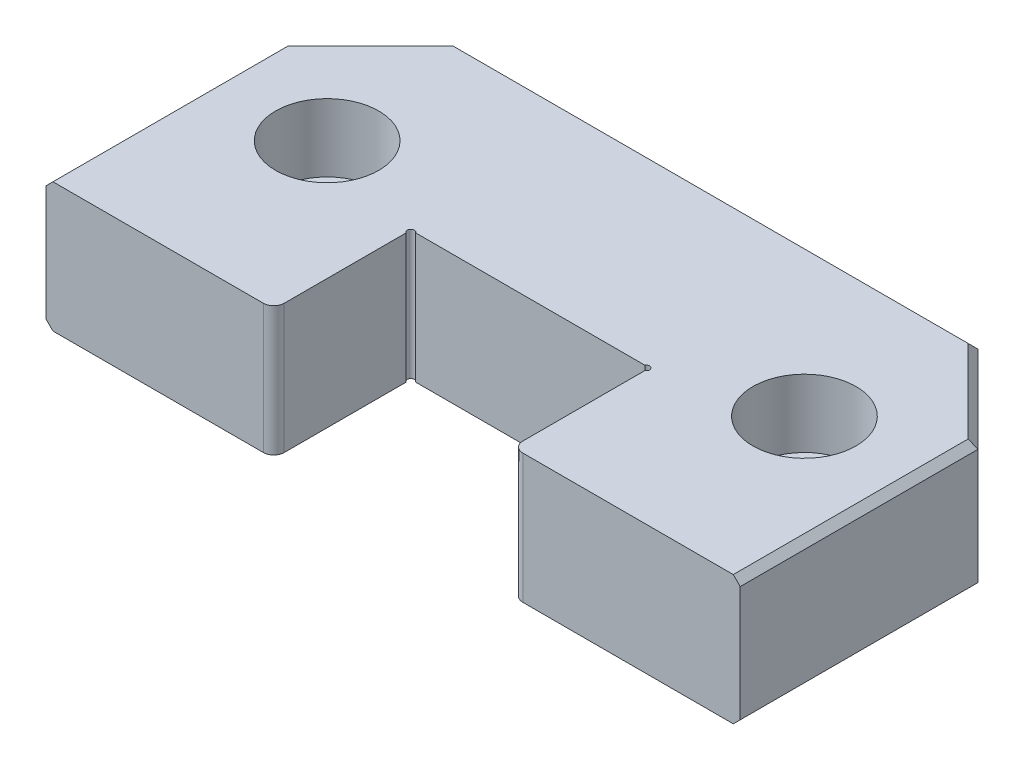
ISO-10303-21;
HEADER;
FILE_DESCRIPTION(('STEP AP214'),'2;1');
FILE_NAME('part.step','',(''),(''),'','','');
FILE_SCHEMA(('AUTOMOTIVE_DESIGN { 1 0 10303 214 1 1 1 1 }'));
ENDSEC;
DATA;
#1=APPLICATION_CONTEXT('core data for automotive mechanical design processes');
#2=APPLICATION_PROTOCOL_DEFINITION('international standard','automotive_design',2000,#1);
#3=PRODUCT_CONTEXT('',#1,'mechanical');
#4=PRODUCT('Part','Part','',(#3));
#5=PRODUCT_RELATED_PRODUCT_CATEGORY('part','',(#4));
#6=PRODUCT_DEFINITION_FORMATION('','',#4);
#7=PRODUCT_DEFINITION_CONTEXT('part definition',#1,'design');
#8=PRODUCT_DEFINITION('design','',#6,#7);
#9=PRODUCT_DEFINITION_SHAPE('','',#8);
#10=(LENGTH_UNIT() NAMED_UNIT(*) SI_UNIT(.MILLI.,.METRE.));
#11=(NAMED_UNIT(*) PLANE_ANGLE_UNIT() SI_UNIT($,.RADIAN.));
#12=(NAMED_UNIT(*) SI_UNIT($,.STERADIAN.) SOLID_ANGLE_UNIT());
#13=UNCERTAINTY_MEASURE_WITH_UNIT(LENGTH_MEASURE(1.E-05),#10,'distance_accuracy_value','');
#14=(GEOMETRIC_REPRESENTATION_CONTEXT(3) GLOBAL_UNCERTAINTY_ASSIGNED_CONTEXT((#13)) GLOBAL_UNIT_ASSIGNED_CONTEXT((#10,
#11,#12)) REPRESENTATION_CONTEXT('',''));
#15=CARTESIAN_POINT('',(0.,0.,0.));
#16=DIRECTION('',(0.,0.,1.));
#17=DIRECTION('',(1.,0.,0.));
#18=AXIS2_PLACEMENT_3D('',#15,#16,#17);
#19=CARTESIAN_POINT('',(-34.925,15.748,-25.273));
#20=DIRECTION('',(0.,-1.,0.));
#21=DIRECTION('',(0.,0.,-1.));
#22=AXIS2_PLACEMENT_3D('',#19,#20,#21);
#23=CYLINDRICAL_SURFACE('',#22,5.1562);
#24=CARTESIAN_POINT('',(-34.925,0.,-25.273));
#25=DIRECTION('',(0.,-1.,0.));
#26=DIRECTION('',(0.,0.,-1.));
#27=AXIS2_PLACEMENT_3D('',#24,#25,#26);
#28=CIRCLE('',#27,5.1562);
#29=CARTESIAN_POINT('',(-34.925,0.,-30.4292));
#30=VERTEX_POINT('',#29);
#31=EDGE_CURVE('E267',#30,#30,#28,.T.);
#32=ORIENTED_EDGE('',*,*,#31,.T.);
#33=EDGE_LOOP('',(#32));
#34=FACE_BOUND('',#33,.T.);
#35=CARTESIAN_POINT('',(-34.925,8.9916,-25.273));
#36=DIRECTION('',(0.,1.,0.));
#37=DIRECTION('',(0.,0.,1.));
#38=AXIS2_PLACEMENT_3D('',#35,#36,#37);
#39=CIRCLE('',#38,5.1562);
#40=CARTESIAN_POINT('',(-34.925,8.9916,-20.1168));
#41=VERTEX_POINT('',#40);
#42=EDGE_CURVE('E269',#41,#41,#39,.F.);
#43=ORIENTED_EDGE('',*,*,#42,.F.);
#44=EDGE_LOOP('',(#43));
#45=FACE_BOUND('',#44,.T.);
#46=ADVANCED_FACE('F32',(#34,#45),#23,.F.);
#47=CARTESIAN_POINT('',(34.925,15.748,-25.273));
#48=DIRECTION('',(0.,-1.,0.));
#49=DIRECTION('',(0.,0.,-1.));
#50=AXIS2_PLACEMENT_3D('',#47,#48,#49);
#51=CYLINDRICAL_SURFACE('',#50,5.1562);
#52=CARTESIAN_POINT('',(34.925,0.,-25.273));
#53=DIRECTION('',(0.,-1.,0.));
#54=DIRECTION('',(0.,0.,-1.));
#55=AXIS2_PLACEMENT_3D('',#52,#53,#54);
#56=CIRCLE('',#55,5.1562);
#57=CARTESIAN_POINT('',(34.925,0.,-30.4292));
#58=VERTEX_POINT('',#57);
#59=EDGE_CURVE('E178',#58,#58,#56,.T.);
#60=ORIENTED_EDGE('',*,*,#59,.T.);
#61=EDGE_LOOP('',(#60));
#62=FACE_BOUND('',#61,.T.);
#63=CARTESIAN_POINT('',(34.925,8.9916,-25.273));
#64=DIRECTION('',(0.,1.,0.));
#65=DIRECTION('',(0.,0.,1.));
#66=AXIS2_PLACEMENT_3D('',#63,#64,#65);
#67=CIRCLE('',#66,5.1562);
#68=CARTESIAN_POINT('',(34.925,8.9916,-20.1168));
#69=VERTEX_POINT('',#68);
#70=EDGE_CURVE('E264',#69,#69,#67,.F.);
#71=ORIENTED_EDGE('',*,*,#70,.F.);
#72=EDGE_LOOP('',(#71));
#73=FACE_BOUND('',#72,.T.);
#74=ADVANCED_FACE('F427',(#62,#73),#51,.F.);
#75=CARTESIAN_POINT('',(-50.8,18.923,0.));
#76=DIRECTION('',(0.,0.,-1.));
#77=DIRECTION('',(-1.,0.,0.));
#78=AXIS2_PLACEMENT_3D('',#75,#76,#77);
#79=PLANE('',#78);
#80=DIRECTION('',(0.,-1.,0.));
#81=VECTOR('',#80,1.);
#82=CARTESIAN_POINT('',(50.8,18.923,0.));
#83=LINE('',#82,#81);
#84=CARTESIAN_POINT('',(50.8,17.907,0.));
#85=VERTEX_POINT('',#84);
#86=CARTESIAN_POINT('',(50.8,1.01599999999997,0.));
#87=VERTEX_POINT('',#86);
#88=EDGE_CURVE('E213',#85,#87,#83,.T.);
#89=ORIENTED_EDGE('',*,*,#88,.F.);
#90=DIRECTION('',(-0.707106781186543,0.707106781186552,0.));
#91=VECTOR('',#90,1.);
#92=CARTESIAN_POINT('',(49.784,18.923,0.));
#93=LINE('',#92,#91);
#94=CARTESIAN_POINT('',(49.784,18.923,0.));
#95=VERTEX_POINT('',#94);
#96=EDGE_CURVE('E311',#85,#95,#93,.T.);
#97=ORIENTED_EDGE('',*,*,#96,.T.);
#98=DIRECTION('',(1.,0.,0.));
#99=VECTOR('',#98,1.);
#100=CARTESIAN_POINT('',(-50.8,18.923,0.));
#101=LINE('',#100,#99);
#102=CARTESIAN_POINT('',(18.9865,18.923,0.));
#103=VERTEX_POINT('',#102);
#104=EDGE_CURVE('E214',#103,#95,#101,.T.);
#105=ORIENTED_EDGE('',*,*,#104,.F.);
#106=DIRECTION('',(0.,-1.,0.));
#107=VECTOR('',#106,1.);
#108=CARTESIAN_POINT('',(18.9865,18.923,0.));
#109=LINE('',#108,#107);
#110=CARTESIAN_POINT('',(18.9865,0.,0.));
#111=VERTEX_POINT('',#110);
#112=EDGE_CURVE('E258',#103,#111,#109,.T.);
#113=ORIENTED_EDGE('',*,*,#112,.T.);
#114=DIRECTION('',(1.,0.,0.));
#115=VECTOR('',#114,1.);
#116=CARTESIAN_POINT('',(-50.8,0.,0.));
#117=LINE('',#116,#115);
#118=CARTESIAN_POINT('',(49.784,0.,0.));
#119=VERTEX_POINT('',#118);
#120=EDGE_CURVE('E206',#111,#119,#117,.T.);
#121=ORIENTED_EDGE('',*,*,#120,.T.);
#122=DIRECTION('',(-0.707106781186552,-0.707106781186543,0.));
#123=VECTOR('',#122,1.);
#124=CARTESIAN_POINT('',(50.8,1.01599999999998,0.));
#125=LINE('',#124,#123);
#126=EDGE_CURVE('E309',#119,#87,#125,.F.);
#127=ORIENTED_EDGE('',*,*,#126,.T.);
#128=EDGE_LOOP('',(#89,#97,#105,#113,#121,#127));
#129=FACE_BOUND('',#128,.T.);
#130=ADVANCED_FACE('F400',(#129),#79,.F.);
#131=CARTESIAN_POINT('',(-50.8,18.923,-47.498));
#132=DIRECTION('',(1.,0.,0.));
#133=DIRECTION('',(0.,0.,-1.));
#134=AXIS2_PLACEMENT_3D('',#131,#132,#133);
#135=PLANE('',#134);
#136=DIRECTION('',(0.,-1.,0.));
#137=VECTOR('',#136,1.);
#138=CARTESIAN_POINT('',(-50.8,18.923,0.));
#139=LINE('',#138,#137);
#140=CARTESIAN_POINT('',(-50.8,17.907,0.));
#141=VERTEX_POINT('',#140);
#142=CARTESIAN_POINT('',(-50.8,1.01599999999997,0.));
#143=VERTEX_POINT('',#142);
#144=EDGE_CURVE('E219',#141,#143,#139,.T.);
#145=ORIENTED_EDGE('',*,*,#144,.F.);
#146=DIRECTION('',(0.,0.,-1.));
#147=VECTOR('',#146,1.);
#148=CARTESIAN_POINT('',(-50.8,17.907,-34.798));
#149=LINE('',#148,#147);
#150=CARTESIAN_POINT('',(-50.8,17.907,-34.798));
#151=VERTEX_POINT('',#150);
#152=EDGE_CURVE('E290',#141,#151,#149,.T.);
#153=ORIENTED_EDGE('',*,*,#152,.T.);
#154=DIRECTION('',(0.,-1.,0.));
#155=VECTOR('',#154,1.);
#156=CARTESIAN_POINT('',(-50.8,18.923,-34.798));
#157=LINE('',#156,#155);
#158=CARTESIAN_POINT('',(-50.8,1.01599999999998,-34.798));
#159=VERTEX_POINT('',#158);
#160=EDGE_CURVE('E231',#151,#159,#157,.T.);
#161=ORIENTED_EDGE('',*,*,#160,.T.);
#162=DIRECTION('',(0.,0.,1.));
#163=VECTOR('',#162,1.);
#164=CARTESIAN_POINT('',(-50.8,1.01599999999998,-47.498));
#165=LINE('',#164,#163);
#166=EDGE_CURVE('E288',#159,#143,#165,.T.);
#167=ORIENTED_EDGE('',*,*,#166,.T.);
#168=EDGE_LOOP('',(#145,#153,#161,#167));
#169=FACE_BOUND('',#168,.T.);
#170=ADVANCED_FACE('F353',(#169),#135,.F.);
#171=CARTESIAN_POINT('',(-49.784,18.923,0.));
#172=VERTEX_POINT('',#171);
#173=CARTESIAN_POINT('',(-18.9865,18.923,0.));
#174=VERTEX_POINT('',#173);
#175=EDGE_CURVE('E211',#172,#174,#101,.T.);
#176=ORIENTED_EDGE('',*,*,#175,.F.);
#177=DIRECTION('',(-0.707106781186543,-0.707106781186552,0.));
#178=VECTOR('',#177,1.);
#179=CARTESIAN_POINT('',(-49.784,18.923,0.));
#180=LINE('',#179,#178);
#181=EDGE_CURVE('E286',#172,#141,#180,.T.);
#182=ORIENTED_EDGE('',*,*,#181,.T.);
#183=ORIENTED_EDGE('',*,*,#144,.T.);
#184=DIRECTION('',(-0.707106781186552,0.707106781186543,0.));
#185=VECTOR('',#184,1.);
#186=CARTESIAN_POINT('',(-50.8,1.01599999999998,0.));
#187=LINE('',#186,#185);
#188=CARTESIAN_POINT('',(-49.784,0.,0.));
#189=VERTEX_POINT('',#188);
#190=EDGE_CURVE('E284',#143,#189,#187,.F.);
#191=ORIENTED_EDGE('',*,*,#190,.T.);
#192=CARTESIAN_POINT('',(-18.9865,0.,0.));
#193=VERTEX_POINT('',#192);
#194=EDGE_CURVE('E215',#189,#193,#117,.T.);
#195=ORIENTED_EDGE('',*,*,#194,.T.);
#196=DIRECTION('',(0.,1.,0.));
#197=VECTOR('',#196,1.);
#198=CARTESIAN_POINT('',(-18.9865,18.923,0.));
#199=LINE('',#198,#197);
#200=EDGE_CURVE('E245',#193,#174,#199,.T.);
#201=ORIENTED_EDGE('',*,*,#200,.T.);
#202=EDGE_LOOP('',(#176,#182,#183,#191,#195,#201));
#203=FACE_BOUND('',#202,.T.);
#204=ADVANCED_FACE('F358',(#203),#79,.F.);
#205=CARTESIAN_POINT('',(50.8,18.923,-47.498));
#206=DIRECTION('',(-1.,0.,0.));
#207=DIRECTION('',(0.,0.,1.));
#208=AXIS2_PLACEMENT_3D('',#205,#206,#207);
#209=PLANE('',#208);
#210=DIRECTION('',(0.,1.,0.));
#211=VECTOR('',#210,1.);
#212=CARTESIAN_POINT('',(50.8,18.923,-34.798));
#213=LINE('',#212,#211);
#214=CARTESIAN_POINT('',(50.8,1.01599999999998,-34.798));
#215=VERTEX_POINT('',#214);
#216=CARTESIAN_POINT('',(50.8,17.907,-34.798));
#217=VERTEX_POINT('',#216);
#218=EDGE_CURVE('E228',#215,#217,#213,.T.);
#219=ORIENTED_EDGE('',*,*,#218,.T.);
#220=DIRECTION('',(0.,0.,1.));
#221=VECTOR('',#220,1.);
#222=CARTESIAN_POINT('',(50.8,17.907,0.));
#223=LINE('',#222,#221);
#224=EDGE_CURVE('E307',#217,#85,#223,.T.);
#225=ORIENTED_EDGE('',*,*,#224,.T.);
#226=ORIENTED_EDGE('',*,*,#88,.T.);
#227=DIRECTION('',(0.,0.,-1.));
#228=VECTOR('',#227,1.);
#229=CARTESIAN_POINT('',(50.8,1.01599999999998,-47.498));
#230=LINE('',#229,#228);
#231=EDGE_CURVE('E304',#87,#215,#230,.T.);
#232=ORIENTED_EDGE('',*,*,#231,.T.);
#233=EDGE_LOOP('',(#219,#225,#226,#232));
#234=FACE_BOUND('',#233,.T.);
#235=ADVANCED_FACE('F390',(#234),#209,.F.);
#236=CARTESIAN_POINT('',(-50.8,18.923,-47.498));
#237=DIRECTION('',(0.,0.,1.));
#238=DIRECTION('',(1.,0.,0.));
#239=AXIS2_PLACEMENT_3D('',#236,#237,#238);
#240=PLANE('',#239);
#241=DIRECTION('',(0.,1.,0.));
#242=VECTOR('',#241,1.);
#243=CARTESIAN_POINT('',(-38.1,18.923,-47.498));
#244=LINE('',#243,#242);
#245=CARTESIAN_POINT('',(-38.1,1.01599999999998,-47.498));
#246=VERTEX_POINT('',#245);
#247=CARTESIAN_POINT('',(-38.1,17.907,-47.498));
#248=VERTEX_POINT('',#247);
#249=EDGE_CURVE('E222',#246,#248,#244,.T.);
#250=ORIENTED_EDGE('',*,*,#249,.T.);
#251=DIRECTION('',(1.,0.,0.));
#252=VECTOR('',#251,1.);
#253=CARTESIAN_POINT('',(38.1000000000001,17.907,-47.498));
#254=LINE('',#253,#252);
#255=CARTESIAN_POINT('',(38.1,17.907,-47.498));
#256=VERTEX_POINT('',#255);
#257=EDGE_CURVE('E298',#248,#256,#254,.T.);
#258=ORIENTED_EDGE('',*,*,#257,.T.);
#259=DIRECTION('',(0.,-1.,0.));
#260=VECTOR('',#259,1.);
#261=CARTESIAN_POINT('',(38.1,18.923,-47.498));
#262=LINE('',#261,#260);
#263=CARTESIAN_POINT('',(38.1,1.01599999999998,-47.498));
#264=VERTEX_POINT('',#263);
#265=EDGE_CURVE('E225',#256,#264,#262,.T.);
#266=ORIENTED_EDGE('',*,*,#265,.T.);
#267=DIRECTION('',(-1.,0.,0.));
#268=VECTOR('',#267,1.);
#269=CARTESIAN_POINT('',(-50.8,1.01599999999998,-47.498));
#270=LINE('',#269,#268);
#271=EDGE_CURVE('E296',#264,#246,#270,.T.);
#272=ORIENTED_EDGE('',*,*,#271,.T.);
#273=EDGE_LOOP('',(#250,#258,#266,#272));
#274=FACE_BOUND('',#273,.T.);
#275=ADVANCED_FACE('F375',(#274),#240,.F.);
#276=CARTESIAN_POINT('',(-50.8,18.923,0.));
#277=DIRECTION('',(0.,1.,0.));
#278=DIRECTION('',(0.,0.,1.));
#279=AXIS2_PLACEMENT_3D('',#276,#277,#278);
#280=PLANE('',#279);
#281=CARTESIAN_POINT('',(-34.925,18.923,-25.273));
#282=DIRECTION('',(0.,1.,0.));
#283=DIRECTION('',(0.,0.,1.));
#284=AXIS2_PLACEMENT_3D('',#281,#282,#283);
#285=CIRCLE('',#284,7.5438);
#286=CARTESIAN_POINT('',(-34.925,18.923,-17.7292));
#287=VERTEX_POINT('',#286);
#288=EDGE_CURVE('E331',#287,#287,#285,.T.);
#289=ORIENTED_EDGE('',*,*,#288,.F.);
#290=EDGE_LOOP('',(#289));
#291=FACE_BOUND('',#290,.T.);
#292=CARTESIAN_POINT('',(34.925,18.923,-25.273));
#293=DIRECTION('',(0.,1.,0.));
#294=DIRECTION('',(0.,0.,1.));
#295=AXIS2_PLACEMENT_3D('',#292,#293,#294);
#296=CIRCLE('',#295,7.54380000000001);
#297=CARTESIAN_POINT('',(34.925,18.923,-17.7292));
#298=VERTEX_POINT('',#297);
#299=EDGE_CURVE('E272',#298,#298,#296,.T.);
#300=ORIENTED_EDGE('',*,*,#299,.F.);
#301=EDGE_LOOP('',(#300));
#302=FACE_BOUND('',#301,.T.);
#303=DIRECTION('',(-0.707106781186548,0.,0.707106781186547));
#304=VECTOR('',#303,1.);
#305=CARTESIAN_POINT('',(-67.4805795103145,18.923,-16.6805795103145));
#306=LINE('',#305,#304);
#307=CARTESIAN_POINT('',(-37.6791590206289,18.923,-46.482));
#308=VERTEX_POINT('',#307);
#309=CARTESIAN_POINT('',(-49.784,18.923,-34.3771590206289));
#310=VERTEX_POINT('',#309);
#311=EDGE_CURVE('E279',#308,#310,#306,.T.);
#312=ORIENTED_EDGE('',*,*,#311,.T.);
#313=DIRECTION('',(0.,0.,1.));
#314=VECTOR('',#313,1.);
#315=CARTESIAN_POINT('',(-49.784,18.923,0.));
#316=LINE('',#315,#314);
#317=EDGE_CURVE('E281',#310,#172,#316,.T.);
#318=ORIENTED_EDGE('',*,*,#317,.T.);
#319=ORIENTED_EDGE('',*,*,#175,.T.);
#320=CARTESIAN_POINT('',(-18.9865,18.923,-1.524));
#321=DIRECTION('',(0.,1.,0.));
#322=DIRECTION('',(0.,0.,1.));
#323=AXIS2_PLACEMENT_3D('',#320,#321,#322);
#324=CIRCLE('',#323,1.524);
#325=CARTESIAN_POINT('',(-17.4625,18.923,-1.524));
#326=VERTEX_POINT('',#325);
#327=EDGE_CURVE('E175',#174,#326,#324,.T.);
#328=ORIENTED_EDGE('',*,*,#327,.T.);
#329=DIRECTION('',(0.,0.,-1.));
#330=VECTOR('',#329,1.);
#331=CARTESIAN_POINT('',(-17.4625,18.923,-19.3720590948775));
#332=LINE('',#331,#330);
#333=CARTESIAN_POINT('',(-17.4625,18.923,-19.3720590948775));
#334=VERTEX_POINT('',#333);
#335=EDGE_CURVE('E168',#326,#334,#332,.T.);
#336=ORIENTED_EDGE('',*,*,#335,.T.);
#337=CARTESIAN_POINT('',(-17.2085,18.923,-19.812));
#338=DIRECTION('',(0.,-1.,0.));
#339=DIRECTION('',(0.,0.,-1.));
#340=AXIS2_PLACEMENT_3D('',#337,#338,#339);
#341=CIRCLE('',#340,0.508);
#342=CARTESIAN_POINT('',(-16.7685590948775,18.923,-20.066));
#343=VERTEX_POINT('',#342);
#344=EDGE_CURVE('E173',#334,#343,#341,.T.);
#345=ORIENTED_EDGE('',*,*,#344,.T.);
#346=DIRECTION('',(1.,0.,0.));
#347=VECTOR('',#346,1.);
#348=CARTESIAN_POINT('',(-16.7685590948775,18.923,-20.066));
#349=LINE('',#348,#347);
#350=CARTESIAN_POINT('',(16.7685590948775,18.923,-20.066));
#351=VERTEX_POINT('',#350);
#352=EDGE_CURVE('E193',#343,#351,#349,.T.);
#353=ORIENTED_EDGE('',*,*,#352,.T.);
#354=CARTESIAN_POINT('',(17.2085,18.923,-19.812));
#355=DIRECTION('',(0.,-1.,0.));
#356=DIRECTION('',(0.,0.,-1.));
#357=AXIS2_PLACEMENT_3D('',#354,#355,#356);
#358=CIRCLE('',#357,0.508000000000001);
#359=CARTESIAN_POINT('',(17.4625,18.923,-19.3720590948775));
#360=VERTEX_POINT('',#359);
#361=EDGE_CURVE('E195',#351,#360,#358,.T.);
#362=ORIENTED_EDGE('',*,*,#361,.T.);
#363=DIRECTION('',(0.,0.,1.));
#364=VECTOR('',#363,1.);
#365=CARTESIAN_POINT('',(17.4625,18.923,-19.3720590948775));
#366=LINE('',#365,#364);
#367=CARTESIAN_POINT('',(17.4625,18.923,-1.524));
#368=VERTEX_POINT('',#367);
#369=EDGE_CURVE('E188',#360,#368,#366,.T.);
#370=ORIENTED_EDGE('',*,*,#369,.T.);
#371=CARTESIAN_POINT('',(18.9865,18.923,-1.524));
#372=DIRECTION('',(0.,1.,0.));
#373=DIRECTION('',(0.,0.,1.));
#374=AXIS2_PLACEMENT_3D('',#371,#372,#373);
#375=CIRCLE('',#374,1.524);
#376=EDGE_CURVE('E248',#368,#103,#375,.T.);
#377=ORIENTED_EDGE('',*,*,#376,.T.);
#378=ORIENTED_EDGE('',*,*,#104,.T.);
#379=DIRECTION('',(0.,0.,-1.));
#380=VECTOR('',#379,1.);
#381=CARTESIAN_POINT('',(49.784,18.923,-34.798));
#382=LINE('',#381,#380);
#383=CARTESIAN_POINT('',(49.784,18.923,-34.3771590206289));
#384=VERTEX_POINT('',#383);
#385=EDGE_CURVE('E263',#95,#384,#382,.T.);
#386=ORIENTED_EDGE('',*,*,#385,.T.);
#387=DIRECTION('',(-0.707106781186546,0.,-0.707106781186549));
#388=VECTOR('',#387,1.);
#389=CARTESIAN_POINT('',(16.6805795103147,18.923,-67.4805795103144));
#390=LINE('',#389,#388);
#391=CARTESIAN_POINT('',(37.679159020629,18.923,-46.482));
#392=VERTEX_POINT('',#391);
#393=EDGE_CURVE('E275',#384,#392,#390,.T.);
#394=ORIENTED_EDGE('',*,*,#393,.T.);
#395=DIRECTION('',(-1.,0.,0.));
#396=VECTOR('',#395,1.);
#397=CARTESIAN_POINT('',(-38.0999999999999,18.923,-46.482));
#398=LINE('',#397,#396);
#399=EDGE_CURVE('E277',#392,#308,#398,.T.);
#400=ORIENTED_EDGE('',*,*,#399,.T.);
#401=EDGE_LOOP('',(#312,#318,#319,#328,#336,#345,#353,#362,#370,#377,#378,#386,#394,#400));
#402=FACE_BOUND('',#401,.T.);
#403=ADVANCED_FACE('F170',(#291,#302,#402),#280,.T.);
#404=CARTESIAN_POINT('',(-50.8,0.,0.));
#405=DIRECTION('',(0.,1.,0.));
#406=DIRECTION('',(0.,0.,1.));
#407=AXIS2_PLACEMENT_3D('',#404,#405,#406);
#408=PLANE('',#407);
#409=ORIENTED_EDGE('',*,*,#31,.F.);
#410=EDGE_LOOP('',(#409));
#411=FACE_BOUND('',#410,.T.);
#412=ORIENTED_EDGE('',*,*,#59,.F.);
#413=EDGE_LOOP('',(#412));
#414=FACE_BOUND('',#413,.T.);
#415=DIRECTION('',(0.707106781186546,0.,0.707106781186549));
#416=VECTOR('',#415,1.);
#417=CARTESIAN_POINT('',(50.0815795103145,0.,-34.0795795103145));
#418=LINE('',#417,#416);
#419=CARTESIAN_POINT('',(37.679159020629,0.,-46.482));
#420=VERTEX_POINT('',#419);
#421=CARTESIAN_POINT('',(49.784,0.,-34.3771590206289));
#422=VERTEX_POINT('',#421);
#423=EDGE_CURVE('E41',#420,#422,#418,.T.);
#424=ORIENTED_EDGE('',*,*,#423,.T.);
#425=DIRECTION('',(0.,0.,1.));
#426=VECTOR('',#425,1.);
#427=CARTESIAN_POINT('',(49.784,0.,0.));
#428=LINE('',#427,#426);
#429=EDGE_CURVE('E11',#422,#119,#428,.T.);
#430=ORIENTED_EDGE('',*,*,#429,.T.);
#431=ORIENTED_EDGE('',*,*,#120,.F.);
#432=CARTESIAN_POINT('',(18.9865,0.,-1.524));
#433=DIRECTION('',(0.,1.,0.));
#434=DIRECTION('',(0.,0.,1.));
#435=AXIS2_PLACEMENT_3D('',#432,#433,#434);
#436=CIRCLE('',#435,1.524);
#437=CARTESIAN_POINT('',(17.4625,0.,-1.524));
#438=VERTEX_POINT('',#437);
#439=EDGE_CURVE('E253',#111,#438,#436,.F.);
#440=ORIENTED_EDGE('',*,*,#439,.T.);
#441=DIRECTION('',(0.,0.,-1.));
#442=VECTOR('',#441,1.);
#443=CARTESIAN_POINT('',(17.4625,0.,0.));
#444=LINE('',#443,#442);
#445=CARTESIAN_POINT('',(17.4625,0.,-19.3720590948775));
#446=VERTEX_POINT('',#445);
#447=EDGE_CURVE('E243',#438,#446,#444,.T.);
#448=ORIENTED_EDGE('',*,*,#447,.T.);
#449=CARTESIAN_POINT('',(17.2085,0.,-19.812));
#450=DIRECTION('',(0.,1.,0.));
#451=DIRECTION('',(0.,0.,1.));
#452=AXIS2_PLACEMENT_3D('',#449,#450,#451);
#453=CIRCLE('',#452,0.508000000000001);
#454=CARTESIAN_POINT('',(16.7685590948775,0.,-20.066));
#455=VERTEX_POINT('',#454);
#456=EDGE_CURVE('E240',#446,#455,#453,.T.);
#457=ORIENTED_EDGE('',*,*,#456,.T.);
#458=DIRECTION('',(-1.,0.,0.));
#459=VECTOR('',#458,1.);
#460=CARTESIAN_POINT('',(-50.8,0.,-20.066));
#461=LINE('',#460,#459);
#462=CARTESIAN_POINT('',(-16.7685590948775,0.,-20.066));
#463=VERTEX_POINT('',#462);
#464=EDGE_CURVE('E237',#455,#463,#461,.T.);
#465=ORIENTED_EDGE('',*,*,#464,.T.);
#466=CARTESIAN_POINT('',(-17.2085,0.,-19.812));
#467=DIRECTION('',(0.,1.,0.));
#468=DIRECTION('',(0.,0.,1.));
#469=AXIS2_PLACEMENT_3D('',#466,#467,#468);
#470=CIRCLE('',#469,0.508);
#471=CARTESIAN_POINT('',(-17.4625,0.,-19.3720590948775));
#472=VERTEX_POINT('',#471);
#473=EDGE_CURVE('E235',#463,#472,#470,.T.);
#474=ORIENTED_EDGE('',*,*,#473,.T.);
#475=DIRECTION('',(0.,0.,1.));
#476=VECTOR('',#475,1.);
#477=CARTESIAN_POINT('',(-17.4625,0.,0.));
#478=LINE('',#477,#476);
#479=CARTESIAN_POINT('',(-17.4625,0.,-1.524));
#480=VERTEX_POINT('',#479);
#481=EDGE_CURVE('E184',#472,#480,#478,.T.);
#482=ORIENTED_EDGE('',*,*,#481,.T.);
#483=CARTESIAN_POINT('',(-18.9865,0.,-1.524));
#484=DIRECTION('',(0.,1.,0.));
#485=DIRECTION('',(0.,0.,1.));
#486=AXIS2_PLACEMENT_3D('',#483,#484,#485);
#487=CIRCLE('',#486,1.524);
#488=EDGE_CURVE('E255',#480,#193,#487,.F.);
#489=ORIENTED_EDGE('',*,*,#488,.T.);
#490=ORIENTED_EDGE('',*,*,#194,.F.);
#491=DIRECTION('',(0.,0.,-1.));
#492=VECTOR('',#491,1.);
#493=CARTESIAN_POINT('',(-49.784,0.,0.));
#494=LINE('',#493,#492);
#495=CARTESIAN_POINT('',(-49.784,0.,-34.3771590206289));
#496=VERTEX_POINT('',#495);
#497=EDGE_CURVE('E313',#189,#496,#494,.T.);
#498=ORIENTED_EDGE('',*,*,#497,.T.);
#499=DIRECTION('',(0.707106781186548,0.,-0.707106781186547));
#500=VECTOR('',#499,1.);
#501=CARTESIAN_POINT('',(-37.3815795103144,0.,-46.7795795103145));
#502=LINE('',#501,#500);
#503=CARTESIAN_POINT('',(-37.6791590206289,0.,-46.482));
#504=VERTEX_POINT('',#503);
#505=EDGE_CURVE('E315',#496,#504,#502,.T.);
#506=ORIENTED_EDGE('',*,*,#505,.T.);
#507=DIRECTION('',(1.,0.,0.));
#508=VECTOR('',#507,1.);
#509=CARTESIAN_POINT('',(-50.8,0.,-46.482));
#510=LINE('',#509,#508);
#511=EDGE_CURVE('E52',#504,#420,#510,.T.);
#512=ORIENTED_EDGE('',*,*,#511,.T.);
#513=EDGE_LOOP('',(#424,#430,#431,#440,#448,#457,#465,#474,#482,#489,#490,#498,#506,#512));
#514=FACE_BOUND('',#513,.T.);
#515=ADVANCED_FACE('F410',(#411,#414,#514),#408,.F.);
#516=CARTESIAN_POINT('',(38.1,18.923,-47.498));
#517=DIRECTION('',(-0.707106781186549,0.,0.707106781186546));
#518=DIRECTION('',(0.707106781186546,0.,0.707106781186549));
#519=AXIS2_PLACEMENT_3D('',#516,#517,#518);
#520=PLANE('',#519);
#521=ORIENTED_EDGE('',*,*,#265,.F.);
#522=DIRECTION('',(-0.707106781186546,0.,-0.707106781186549));
#523=VECTOR('',#522,1.);
#524=CARTESIAN_POINT('',(38.1,17.907,-47.498));
#525=LINE('',#524,#523);
#526=EDGE_CURVE('E302',#256,#217,#525,.F.);
#527=ORIENTED_EDGE('',*,*,#526,.T.);
#528=ORIENTED_EDGE('',*,*,#218,.F.);
#529=DIRECTION('',(0.707106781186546,0.,0.707106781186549));
#530=VECTOR('',#529,1.);
#531=CARTESIAN_POINT('',(38.1,1.01599999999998,-47.498));
#532=LINE('',#531,#530);
#533=EDGE_CURVE('E300',#215,#264,#532,.F.);
#534=ORIENTED_EDGE('',*,*,#533,.T.);
#535=EDGE_LOOP('',(#521,#527,#528,#534));
#536=FACE_BOUND('',#535,.T.);
#537=ADVANCED_FACE('F387',(#536),#520,.F.);
#538=CARTESIAN_POINT('',(-50.8,18.923,-34.798));
#539=DIRECTION('',(0.707106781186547,0.,0.707106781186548));
#540=DIRECTION('',(0.707106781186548,0.,-0.707106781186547));
#541=AXIS2_PLACEMENT_3D('',#538,#539,#540);
#542=PLANE('',#541);
#543=ORIENTED_EDGE('',*,*,#160,.F.);
#544=DIRECTION('',(-0.707106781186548,0.,0.707106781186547));
#545=VECTOR('',#544,1.);
#546=CARTESIAN_POINT('',(-50.8,17.907,-34.798));
#547=LINE('',#546,#545);
#548=EDGE_CURVE('E294',#151,#248,#547,.F.);
#549=ORIENTED_EDGE('',*,*,#548,.T.);
#550=ORIENTED_EDGE('',*,*,#249,.F.);
#551=DIRECTION('',(0.707106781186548,0.,-0.707106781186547));
#552=VECTOR('',#551,1.);
#553=CARTESIAN_POINT('',(-50.8,1.01599999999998,-34.798));
#554=LINE('',#553,#552);
#555=EDGE_CURVE('E292',#246,#159,#554,.F.);
#556=ORIENTED_EDGE('',*,*,#555,.T.);
#557=EDGE_LOOP('',(#543,#549,#550,#556));
#558=FACE_BOUND('',#557,.T.);
#559=ADVANCED_FACE('F372',(#558),#542,.F.);
#560=CARTESIAN_POINT('',(17.4625,18.923,-19.3720590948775));
#561=DIRECTION('',(1.,0.,0.));
#562=DIRECTION('',(0.,0.,-1.));
#563=AXIS2_PLACEMENT_3D('',#560,#561,#562);
#564=PLANE('',#563);
#565=ORIENTED_EDGE('',*,*,#447,.F.);
#566=DIRECTION('',(0.,-1.,0.));
#567=VECTOR('',#566,1.);
#568=CARTESIAN_POINT('',(17.4625,18.923,-1.524));
#569=LINE('',#568,#567);
#570=EDGE_CURVE('E261',#438,#368,#569,.F.);
#571=ORIENTED_EDGE('',*,*,#570,.T.);
#572=ORIENTED_EDGE('',*,*,#369,.F.);
#573=DIRECTION('',(0.,-1.,0.));
#574=VECTOR('',#573,1.);
#575=CARTESIAN_POINT('',(17.4625,18.923,-19.3720590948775));
#576=LINE('',#575,#574);
#577=EDGE_CURVE('E203',#360,#446,#576,.T.);
#578=ORIENTED_EDGE('',*,*,#577,.T.);
#579=EDGE_LOOP('',(#565,#571,#572,#578));
#580=FACE_BOUND('',#579,.T.);
#581=ADVANCED_FACE('F441',(#580),#564,.F.);
#582=CARTESIAN_POINT('',(17.2085,18.923,-19.812));
#583=DIRECTION('',(0.,-1.,0.));
#584=DIRECTION('',(0.,0.,-1.));
#585=AXIS2_PLACEMENT_3D('',#582,#583,#584);
#586=CYLINDRICAL_SURFACE('',#585,0.508000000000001);
#587=ORIENTED_EDGE('',*,*,#577,.F.);
#588=ORIENTED_EDGE('',*,*,#361,.F.);
#589=DIRECTION('',(0.,-1.,0.));
#590=VECTOR('',#589,1.);
#591=CARTESIAN_POINT('',(16.7685590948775,18.923,-20.066));
#592=LINE('',#591,#590);
#593=EDGE_CURVE('E207',#351,#455,#592,.T.);
#594=ORIENTED_EDGE('',*,*,#593,.T.);
#595=ORIENTED_EDGE('',*,*,#456,.F.);
#596=EDGE_LOOP('',(#587,#588,#594,#595));
#597=FACE_BOUND('',#596,.T.);
#598=ADVANCED_FACE('F444',(#597),#586,.F.);
#599=CARTESIAN_POINT('',(-16.7685590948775,18.923,-20.066));
#600=DIRECTION('',(0.,0.,-1.));
#601=DIRECTION('',(-1.,0.,0.));
#602=AXIS2_PLACEMENT_3D('',#599,#600,#601);
#603=PLANE('',#602);
#604=ORIENTED_EDGE('',*,*,#593,.F.);
#605=ORIENTED_EDGE('',*,*,#352,.F.);
#606=DIRECTION('',(0.,-1.,0.));
#607=VECTOR('',#606,1.);
#608=CARTESIAN_POINT('',(-16.7685590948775,18.923,-20.066));
#609=LINE('',#608,#607);
#610=EDGE_CURVE('E187',#343,#463,#609,.T.);
#611=ORIENTED_EDGE('',*,*,#610,.T.);
#612=ORIENTED_EDGE('',*,*,#464,.F.);
#613=EDGE_LOOP('',(#604,#605,#611,#612));
#614=FACE_BOUND('',#613,.T.);
#615=ADVANCED_FACE('F448',(#614),#603,.F.);
#616=CARTESIAN_POINT('',(-17.2085,18.923,-19.812));
#617=DIRECTION('',(0.,-1.,0.));
#618=DIRECTION('',(0.,0.,-1.));
#619=AXIS2_PLACEMENT_3D('',#616,#617,#618);
#620=CYLINDRICAL_SURFACE('',#619,0.508);
#621=ORIENTED_EDGE('',*,*,#610,.F.);
#622=ORIENTED_EDGE('',*,*,#344,.F.);
#623=DIRECTION('',(0.,-1.,0.));
#624=VECTOR('',#623,1.);
#625=CARTESIAN_POINT('',(-17.4625,18.923,-19.3720590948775));
#626=LINE('',#625,#624);
#627=EDGE_CURVE('E181',#334,#472,#626,.T.);
#628=ORIENTED_EDGE('',*,*,#627,.T.);
#629=ORIENTED_EDGE('',*,*,#473,.F.);
#630=EDGE_LOOP('',(#621,#622,#628,#629));
#631=FACE_BOUND('',#630,.T.);
#632=ADVANCED_FACE('F190',(#631),#620,.F.);
#633=CARTESIAN_POINT('',(-17.4625,18.923,-19.3720590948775));
#634=DIRECTION('',(-1.,0.,0.));
#635=DIRECTION('',(0.,0.,1.));
#636=AXIS2_PLACEMENT_3D('',#633,#634,#635);
#637=PLANE('',#636);
#638=ORIENTED_EDGE('',*,*,#335,.F.);
#639=DIRECTION('',(0.,1.,0.));
#640=VECTOR('',#639,1.);
#641=CARTESIAN_POINT('',(-17.4625,18.923,-1.524));
#642=LINE('',#641,#640);
#643=EDGE_CURVE('E251',#326,#480,#642,.F.);
#644=ORIENTED_EDGE('',*,*,#643,.T.);
#645=ORIENTED_EDGE('',*,*,#481,.F.);
#646=ORIENTED_EDGE('',*,*,#627,.F.);
#647=EDGE_LOOP('',(#638,#644,#645,#646));
#648=FACE_BOUND('',#647,.T.);
#649=ADVANCED_FACE('F182',(#648),#637,.F.);
#650=CARTESIAN_POINT('',(-18.9865,18.923,-1.524));
#651=DIRECTION('',(0.,1.,0.));
#652=DIRECTION('',(0.,0.,1.));
#653=AXIS2_PLACEMENT_3D('',#650,#651,#652);
#654=CYLINDRICAL_SURFACE('',#653,1.524);
#655=ORIENTED_EDGE('',*,*,#488,.F.);
#656=ORIENTED_EDGE('',*,*,#643,.F.);
#657=ORIENTED_EDGE('',*,*,#327,.F.);
#658=ORIENTED_EDGE('',*,*,#200,.F.);
#659=EDGE_LOOP('',(#655,#656,#657,#658));
#660=FACE_BOUND('',#659,.T.);
#661=ADVANCED_FACE('F457',(#660),#654,.T.);
#662=CARTESIAN_POINT('',(18.9865,18.923,-1.524));
#663=DIRECTION('',(0.,-1.,0.));
#664=DIRECTION('',(0.,0.,-1.));
#665=AXIS2_PLACEMENT_3D('',#662,#663,#664);
#666=CYLINDRICAL_SURFACE('',#665,1.524);
#667=ORIENTED_EDGE('',*,*,#376,.F.);
#668=ORIENTED_EDGE('',*,*,#570,.F.);
#669=ORIENTED_EDGE('',*,*,#439,.F.);
#670=ORIENTED_EDGE('',*,*,#112,.F.);
#671=EDGE_LOOP('',(#667,#668,#669,#670));
#672=FACE_BOUND('',#671,.T.);
#673=ADVANCED_FACE('F406',(#672),#666,.T.);
#674=CARTESIAN_POINT('',(34.925,8.9916,-25.273));
#675=DIRECTION('',(0.,1.,0.));
#676=DIRECTION('',(0.,0.,1.));
#677=AXIS2_PLACEMENT_3D('',#674,#675,#676);
#678=PLANE('',#677);
#679=CARTESIAN_POINT('',(34.925,8.9916,-25.273));
#680=DIRECTION('',(0.,1.,0.));
#681=DIRECTION('',(0.,0.,1.));
#682=AXIS2_PLACEMENT_3D('',#679,#680,#681);
#683=CIRCLE('',#682,7.54380000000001);
#684=CARTESIAN_POINT('',(34.925,8.9916,-17.7292));
#685=VERTEX_POINT('',#684);
#686=EDGE_CURVE('E268',#685,#685,#683,.T.);
#687=ORIENTED_EDGE('',*,*,#686,.T.);
#688=EDGE_LOOP('',(#687));
#689=FACE_BOUND('',#688,.T.);
#690=ORIENTED_EDGE('',*,*,#70,.T.);
#691=EDGE_LOOP('',(#690));
#692=FACE_BOUND('',#691,.T.);
#693=ADVANCED_FACE('F481',(#689,#692),#678,.T.);
#694=CARTESIAN_POINT('',(34.925,8.9916,-25.273));
#695=DIRECTION('',(0.,1.,0.));
#696=DIRECTION('',(0.,0.,1.));
#697=AXIS2_PLACEMENT_3D('',#694,#695,#696);
#698=CYLINDRICAL_SURFACE('',#697,7.54380000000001);
#699=ORIENTED_EDGE('',*,*,#686,.F.);
#700=EDGE_LOOP('',(#699));
#701=FACE_BOUND('',#700,.T.);
#702=ORIENTED_EDGE('',*,*,#299,.T.);
#703=EDGE_LOOP('',(#702));
#704=FACE_BOUND('',#703,.T.);
#705=ADVANCED_FACE('F438',(#701,#704),#698,.F.);
#706=CARTESIAN_POINT('',(-34.925,8.9916,-25.273));
#707=DIRECTION('',(0.,1.,0.));
#708=DIRECTION('',(0.,0.,1.));
#709=AXIS2_PLACEMENT_3D('',#706,#707,#708);
#710=PLANE('',#709);
#711=CARTESIAN_POINT('',(-34.925,8.9916,-25.273));
#712=DIRECTION('',(0.,1.,0.));
#713=DIRECTION('',(0.,0.,1.));
#714=AXIS2_PLACEMENT_3D('',#711,#712,#713);
#715=CIRCLE('',#714,7.5438);
#716=CARTESIAN_POINT('',(-34.925,8.9916,-17.7292));
#717=VERTEX_POINT('',#716);
#718=EDGE_CURVE('E273',#717,#717,#715,.T.);
#719=ORIENTED_EDGE('',*,*,#718,.T.);
#720=EDGE_LOOP('',(#719));
#721=FACE_BOUND('',#720,.T.);
#722=ORIENTED_EDGE('',*,*,#42,.T.);
#723=EDGE_LOOP('',(#722));
#724=FACE_BOUND('',#723,.T.);
#725=ADVANCED_FACE('F612',(#721,#724),#710,.T.);
#726=CARTESIAN_POINT('',(-34.925,8.9916,-25.273));
#727=DIRECTION('',(0.,1.,0.));
#728=DIRECTION('',(0.,0.,1.));
#729=AXIS2_PLACEMENT_3D('',#726,#727,#728);
#730=CYLINDRICAL_SURFACE('',#729,7.5438);
#731=ORIENTED_EDGE('',*,*,#718,.F.);
#732=EDGE_LOOP('',(#731));
#733=FACE_BOUND('',#732,.T.);
#734=ORIENTED_EDGE('',*,*,#288,.T.);
#735=EDGE_LOOP('',(#734));
#736=FACE_BOUND('',#735,.T.);
#737=ADVANCED_FACE('F492',(#733,#736),#730,.F.);
#738=CARTESIAN_POINT('',(49.784,18.923,0.));
#739=DIRECTION('',(0.707106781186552,0.707106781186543,0.));
#740=DIRECTION('',(-0.707106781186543,0.707106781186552,0.));
#741=AXIS2_PLACEMENT_3D('',#738,#739,#740);
#742=PLANE('',#741);
#743=ORIENTED_EDGE('',*,*,#96,.F.);
#744=ORIENTED_EDGE('',*,*,#224,.F.);
#745=DIRECTION('',(-0.678598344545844,0.678598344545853,0.281084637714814));
#746=VECTOR('',#745,1.);
#747=CARTESIAN_POINT('',(43.2267779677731,25.480222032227,-31.6610687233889));
#748=LINE('',#747,#746);
#749=EDGE_CURVE('E328',#384,#217,#748,.F.);
#750=ORIENTED_EDGE('',*,*,#749,.F.);
#751=ORIENTED_EDGE('',*,*,#385,.F.);
#752=EDGE_LOOP('',(#743,#744,#750,#751));
#753=FACE_BOUND('',#752,.T.);
#754=ADVANCED_FACE('F395',(#753),#742,.T.);
#755=CARTESIAN_POINT('',(16.6805795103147,18.923,-67.4805795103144));
#756=DIRECTION('',(0.500000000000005,0.707106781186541,-0.500000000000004));
#757=DIRECTION('',(-0.816496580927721,0.577350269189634,0.));
#758=AXIS2_PLACEMENT_3D('',#755,#756,#757);
#759=PLANE('',#758);
#760=ORIENTED_EDGE('',*,*,#749,.T.);
#761=ORIENTED_EDGE('',*,*,#526,.F.);
#762=DIRECTION('',(-0.281084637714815,0.678598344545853,0.678598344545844));
#763=VECTOR('',#762,1.);
#764=CARTESIAN_POINT('',(40.025435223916,13.2585881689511,-52.1464118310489));
#765=LINE('',#764,#763);
#766=EDGE_CURVE('E325',#392,#256,#765,.F.);
#767=ORIENTED_EDGE('',*,*,#766,.F.);
#768=ORIENTED_EDGE('',*,*,#393,.F.);
#769=EDGE_LOOP('',(#760,#761,#767,#768));
#770=FACE_BOUND('',#769,.T.);
#771=ADVANCED_FACE('F383',(#770),#759,.T.);
#772=CARTESIAN_POINT('',(-50.8,18.923,-46.482));
#773=DIRECTION('',(0.,0.707106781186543,-0.707106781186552));
#774=DIRECTION('',(0.,0.707106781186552,0.707106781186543));
#775=AXIS2_PLACEMENT_3D('',#772,#773,#774);
#776=PLANE('',#775);
#777=ORIENTED_EDGE('',*,*,#766,.T.);
#778=ORIENTED_EDGE('',*,*,#257,.F.);
#779=DIRECTION('',(0.281084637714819,0.678598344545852,0.678598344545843));
#780=VECTOR('',#779,1.);
#781=CARTESIAN_POINT('',(-38.715817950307,16.4202839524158,-48.9847160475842));
#782=LINE('',#781,#780);
#783=EDGE_CURVE('E322',#308,#248,#782,.F.);
#784=ORIENTED_EDGE('',*,*,#783,.F.);
#785=ORIENTED_EDGE('',*,*,#399,.F.);
#786=EDGE_LOOP('',(#777,#778,#784,#785));
#787=FACE_BOUND('',#786,.T.);
#788=ADVANCED_FACE('F378',(#787),#776,.T.);
#789=CARTESIAN_POINT('',(-67.4805795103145,18.923,-16.6805795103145));
#790=DIRECTION('',(-0.500000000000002,0.707106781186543,-0.500000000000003));
#791=DIRECTION('',(0.,0.577350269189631,0.816496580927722));
#792=AXIS2_PLACEMENT_3D('',#789,#790,#791);
#793=PLANE('',#792);
#794=ORIENTED_EDGE('',*,*,#783,.T.);
#795=ORIENTED_EDGE('',*,*,#548,.F.);
#796=DIRECTION('',(0.678598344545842,0.678598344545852,0.28108463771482));
#797=VECTOR('',#796,1.);
#798=CARTESIAN_POINT('',(-54.5576902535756,14.1493097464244,-36.3544862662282));
#799=LINE('',#798,#797);
#800=EDGE_CURVE('E319',#310,#151,#799,.F.);
#801=ORIENTED_EDGE('',*,*,#800,.F.);
#802=ORIENTED_EDGE('',*,*,#311,.F.);
#803=EDGE_LOOP('',(#794,#795,#801,#802));
#804=FACE_BOUND('',#803,.T.);
#805=ADVANCED_FACE('F369',(#804),#793,.T.);
#806=CARTESIAN_POINT('',(-49.784,18.923,0.));
#807=DIRECTION('',(-0.707106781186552,0.707106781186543,0.));
#808=DIRECTION('',(-0.707106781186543,-0.707106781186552,0.));
#809=AXIS2_PLACEMENT_3D('',#806,#807,#808);
#810=PLANE('',#809);
#811=ORIENTED_EDGE('',*,*,#800,.T.);
#812=ORIENTED_EDGE('',*,*,#152,.F.);
#813=ORIENTED_EDGE('',*,*,#181,.F.);
#814=ORIENTED_EDGE('',*,*,#317,.F.);
#815=EDGE_LOOP('',(#811,#812,#813,#814));
#816=FACE_BOUND('',#815,.T.);
#817=ADVANCED_FACE('F362',(#816),#810,.T.);
#818=CARTESIAN_POINT('',(-50.8,1.01599999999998,-47.498));
#819=DIRECTION('',(0.707106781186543,0.707106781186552,0.));
#820=DIRECTION('',(-0.707106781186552,0.707106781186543,0.));
#821=AXIS2_PLACEMENT_3D('',#818,#819,#820);
#822=PLANE('',#821);
#823=ORIENTED_EDGE('',*,*,#190,.F.);
#824=ORIENTED_EDGE('',*,*,#166,.F.);
#825=DIRECTION('',(0.678598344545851,-0.678598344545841,0.281084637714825));
#826=VECTOR('',#825,1.);
#827=CARTESIAN_POINT('',(-53.222443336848,3.43844333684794,-35.8014088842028));
#828=LINE('',#827,#826);
#829=EDGE_CURVE('E36',#496,#159,#828,.F.);
#830=ORIENTED_EDGE('',*,*,#829,.F.);
#831=ORIENTED_EDGE('',*,*,#497,.F.);
#832=EDGE_LOOP('',(#823,#824,#830,#831));
#833=FACE_BOUND('',#832,.T.);
#834=ADVANCED_FACE('F34',(#833),#822,.F.);
#835=CARTESIAN_POINT('',(-67.4805795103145,0.,-16.6805795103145));
#836=DIRECTION('',(0.499999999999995,0.707106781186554,0.499999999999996));
#837=DIRECTION('',(0.,-0.57735026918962,0.81649658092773));
#838=AXIS2_PLACEMENT_3D('',#835,#836,#837);
#839=PLANE('',#838);
#840=ORIENTED_EDGE('',*,*,#829,.T.);
#841=ORIENTED_EDGE('',*,*,#555,.F.);
#842=DIRECTION('',(0.281084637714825,-0.678598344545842,0.678598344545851));
#843=VECTOR('',#842,1.);
#844=CARTESIAN_POINT('',(-34.3492974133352,-8.03899705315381,-38.4430029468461));
#845=LINE('',#844,#843);
#846=EDGE_CURVE('E336',#504,#246,#845,.F.);
#847=ORIENTED_EDGE('',*,*,#846,.F.);
#848=ORIENTED_EDGE('',*,*,#505,.F.);
#849=EDGE_LOOP('',(#840,#841,#847,#848));
#850=FACE_BOUND('',#849,.T.);
#851=ADVANCED_FACE('F346',(#850),#839,.F.);
#852=CARTESIAN_POINT('',(-50.8,1.01599999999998,-47.498));
#853=DIRECTION('',(0.,0.707106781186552,0.707106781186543));
#854=DIRECTION('',(0.,-0.707106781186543,0.707106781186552));
#855=AXIS2_PLACEMENT_3D('',#852,#853,#854);
#856=PLANE('',#855);
#857=ORIENTED_EDGE('',*,*,#846,.T.);
#858=ORIENTED_EDGE('',*,*,#271,.F.);
#859=DIRECTION('',(-0.281084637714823,-0.678598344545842,0.678598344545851));
#860=VECTOR('',#859,1.);
#861=CARTESIAN_POINT('',(31.0761378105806,-15.9411033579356,-30.5408966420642));
#862=LINE('',#861,#860);
#863=EDGE_CURVE('E334',#420,#264,#862,.F.);
#864=ORIENTED_EDGE('',*,*,#863,.F.);
#865=ORIENTED_EDGE('',*,*,#511,.F.);
#866=EDGE_LOOP('',(#857,#858,#864,#865));
#867=FACE_BOUND('',#866,.T.);
#868=ADVANCED_FACE('F418',(#867),#856,.F.);
#869=CARTESIAN_POINT('',(16.6805795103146,0.,-67.4805795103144));
#870=DIRECTION('',(-0.499999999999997,0.707106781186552,0.499999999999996));
#871=DIRECTION('',(-0.816496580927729,-0.577350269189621,0.));
#872=AXIS2_PLACEMENT_3D('',#869,#870,#871);
#873=PLANE('',#872);
#874=ORIENTED_EDGE('',*,*,#863,.T.);
#875=ORIENTED_EDGE('',*,*,#533,.F.);
#876=DIRECTION('',(-0.678598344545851,-0.678598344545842,0.281084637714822));
#877=VECTOR('',#876,1.);
#878=CARTESIAN_POINT('',(40.8542813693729,-8.92971863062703,-30.6783484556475));
#879=LINE('',#878,#877);
#880=EDGE_CURVE('E332',#422,#215,#879,.F.);
#881=ORIENTED_EDGE('',*,*,#880,.F.);
#882=ORIENTED_EDGE('',*,*,#423,.F.);
#883=EDGE_LOOP('',(#874,#875,#881,#882));
#884=FACE_BOUND('',#883,.T.);
#885=ADVANCED_FACE('F417',(#884),#873,.F.);
#886=CARTESIAN_POINT('',(50.8,1.01599999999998,-47.498));
#887=DIRECTION('',(-0.707106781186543,0.707106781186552,0.));
#888=DIRECTION('',(-0.707106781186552,-0.707106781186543,0.));
#889=AXIS2_PLACEMENT_3D('',#886,#887,#888);
#890=PLANE('',#889);
#891=ORIENTED_EDGE('',*,*,#126,.F.);
#892=ORIENTED_EDGE('',*,*,#429,.F.);
#893=ORIENTED_EDGE('',*,*,#880,.T.);
#894=ORIENTED_EDGE('',*,*,#231,.F.);
#895=EDGE_LOOP('',(#891,#892,#893,#894));
#896=FACE_BOUND('',#895,.T.);
#897=ADVANCED_FACE('F414',(#896),#890,.F.);
#898=CLOSED_SHELL('',(#46,#74,#130,#170,#204,#235,#275,#403,#515,#537,#559,#581,#598,#615,#632,
#649,#661,#673,#693,#705,#725,#737,#754,#771,#788,#805,#817,#834,#851,#868,#885,#897));
#899=MANIFOLD_SOLID_BREP('B2',#898);
#900=ADVANCED_BREP_SHAPE_REPRESENTATION('',(#18,#899),#14);
#901=SHAPE_DEFINITION_REPRESENTATION(#9,#900);
ENDSEC;
END-ISO-10303-21;
